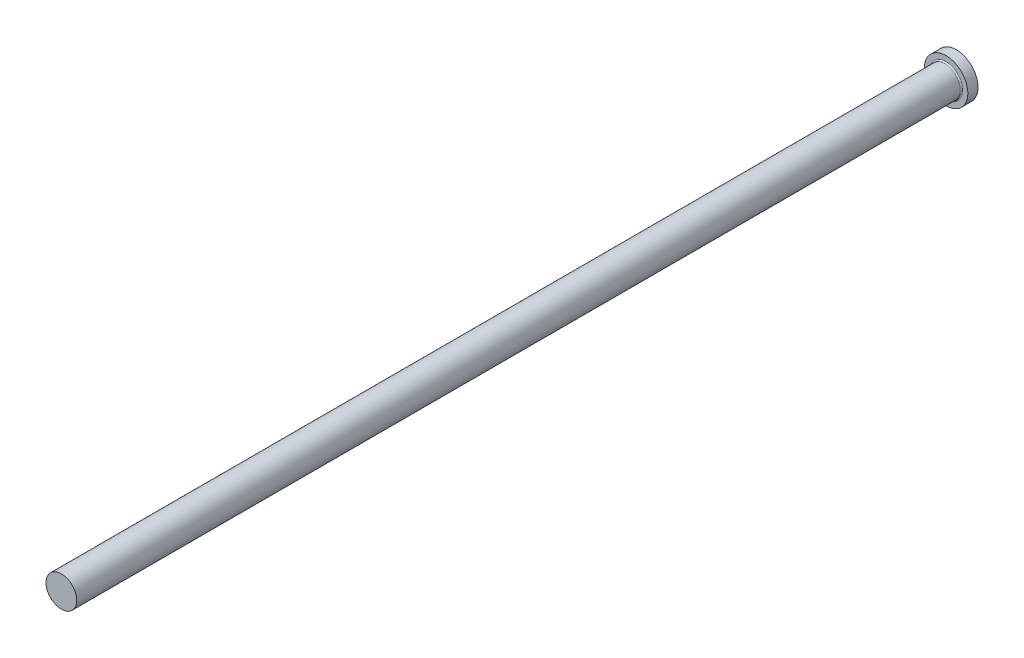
from build123d import *

# Parameters (mm, degrees)
FILLET1_R = 0.5


with BuildPart() as part:
    # FV → Revolve1 (revolve)
    with BuildSketch(Plane(origin=(0, 0, 0), x_dir=(1, 0, 0), z_dir=(0, 1, 0)), mode=Mode.PRIVATE) as revolve1_sk:
        Polygon((0, 0), (8.5, 0), (8.5, -4), (6, -4), (6, -350), (0, -350), align=None)
    revolve(revolve1_sk.sketch.rotate(Axis((0, 0, -9.033228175), (0, 0, 1)), 180), axis=Axis((0, 0, -9.033228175), (0, 0, 1)))

    # Fillet1
    fillet1_edges = [part.edges().sort_by_distance(p)[0] for p in [
        (6, 0, 4),
    ]]
    fillet(fillet1_edges, radius=FILLET1_R)


solid = part.part
